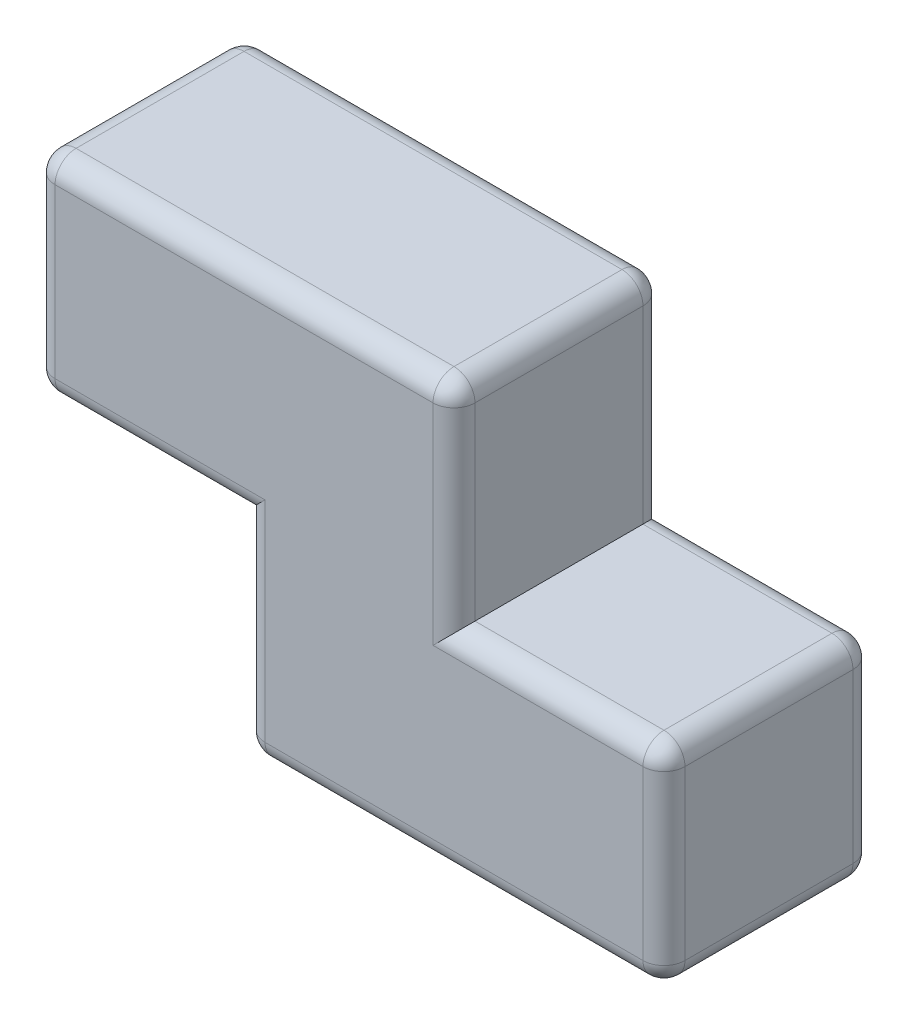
ISO-10303-21;
HEADER;
FILE_DESCRIPTION(('STEP AP214'),'2;1');
FILE_NAME('part.step','',(''),(''),'','','');
FILE_SCHEMA(('AUTOMOTIVE_DESIGN { 1 0 10303 214 1 1 1 1 }'));
ENDSEC;
DATA;
#1=APPLICATION_CONTEXT('core data for automotive mechanical design processes');
#2=APPLICATION_PROTOCOL_DEFINITION('international standard','automotive_design',2000,#1);
#3=PRODUCT_CONTEXT('',#1,'mechanical');
#4=PRODUCT('Part','Part','',(#3));
#5=PRODUCT_RELATED_PRODUCT_CATEGORY('part','',(#4));
#6=PRODUCT_DEFINITION_FORMATION('','',#4);
#7=PRODUCT_DEFINITION_CONTEXT('part definition',#1,'design');
#8=PRODUCT_DEFINITION('design','',#6,#7);
#9=PRODUCT_DEFINITION_SHAPE('','',#8);
#10=(LENGTH_UNIT() NAMED_UNIT(*) SI_UNIT(.MILLI.,.METRE.));
#11=(NAMED_UNIT(*) PLANE_ANGLE_UNIT() SI_UNIT($,.RADIAN.));
#12=(NAMED_UNIT(*) SI_UNIT($,.STERADIAN.) SOLID_ANGLE_UNIT());
#13=UNCERTAINTY_MEASURE_WITH_UNIT(LENGTH_MEASURE(1.E-05),#10,'distance_accuracy_value','');
#14=(GEOMETRIC_REPRESENTATION_CONTEXT(3) GLOBAL_UNCERTAINTY_ASSIGNED_CONTEXT((#13)) GLOBAL_UNIT_ASSIGNED_CONTEXT((#10,
#11,#12)) REPRESENTATION_CONTEXT('',''));
#15=CARTESIAN_POINT('',(0.,0.,0.));
#16=DIRECTION('',(0.,0.,1.));
#17=DIRECTION('',(1.,0.,0.));
#18=AXIS2_PLACEMENT_3D('',#15,#16,#17);
#19=CARTESIAN_POINT('',(-326.4,114.74031182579,100.));
#20=DIRECTION('',(1.,0.,0.));
#21=DIRECTION('',(0.,1.,0.));
#22=AXIS2_PLACEMENT_3D('',#19,#20,#21);
#23=PLANE('',#22);
#24=DIRECTION('',(0.,-1.,0.));
#25=VECTOR('',#24,1.);
#26=CARTESIAN_POINT('',(-326.4,114.74031182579,9.99999999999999));
#27=LINE('',#26,#25);
#28=CARTESIAN_POINT('',(-326.4,104.74031182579,9.99999999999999));
#29=VERTEX_POINT('',#28);
#30=CARTESIAN_POINT('',(-326.4,24.7403118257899,9.99999999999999));
#31=VERTEX_POINT('',#30);
#32=EDGE_CURVE('E284',#29,#31,#27,.T.);
#33=ORIENTED_EDGE('',*,*,#32,.T.);
#34=DIRECTION('',(0.,0.,-1.));
#35=VECTOR('',#34,1.);
#36=CARTESIAN_POINT('',(-326.4,24.7403118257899,100.));
#37=LINE('',#36,#35);
#38=CARTESIAN_POINT('',(-326.4,24.7403118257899,90.));
#39=VERTEX_POINT('',#38);
#40=EDGE_CURVE('E286',#31,#39,#37,.F.);
#41=ORIENTED_EDGE('',*,*,#40,.T.);
#42=DIRECTION('',(0.,-1.,0.));
#43=VECTOR('',#42,1.);
#44=CARTESIAN_POINT('',(-326.4,114.74031182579,90.));
#45=LINE('',#44,#43);
#46=CARTESIAN_POINT('',(-326.4,104.74031182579,90.));
#47=VERTEX_POINT('',#46);
#48=EDGE_CURVE('E282',#39,#47,#45,.F.);
#49=ORIENTED_EDGE('',*,*,#48,.T.);
#50=DIRECTION('',(0.,0.,-1.));
#51=VECTOR('',#50,1.);
#52=CARTESIAN_POINT('',(-326.4,104.74031182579,100.));
#53=LINE('',#52,#51);
#54=EDGE_CURVE('E280',#47,#29,#53,.T.);
#55=ORIENTED_EDGE('',*,*,#54,.T.);
#56=EDGE_LOOP('',(#33,#41,#49,#55));
#57=FACE_BOUND('',#56,.T.);
#58=ADVANCED_FACE('F37',(#57),#23,.F.);
#59=CARTESIAN_POINT('',(-326.4,14.7403118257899,100.));
#60=DIRECTION('',(0.,1.,0.));
#61=DIRECTION('',(0.,0.,1.));
#62=AXIS2_PLACEMENT_3D('',#59,#60,#61);
#63=PLANE('',#62);
#64=DIRECTION('',(0.,0.,-1.));
#65=VECTOR('',#64,1.);
#66=CARTESIAN_POINT('',(-316.4,14.7403118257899,100.));
#67=LINE('',#66,#65);
#68=CARTESIAN_POINT('',(-316.4,14.7403118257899,90.));
#69=VERTEX_POINT('',#68);
#70=CARTESIAN_POINT('',(-316.4,14.7403118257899,9.99999999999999));
#71=VERTEX_POINT('',#70);
#72=EDGE_CURVE('E257',#69,#71,#67,.T.);
#73=ORIENTED_EDGE('',*,*,#72,.T.);
#74=DIRECTION('',(1.,0.,0.));
#75=VECTOR('',#74,1.);
#76=CARTESIAN_POINT('',(-326.4,14.7403118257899,9.99999999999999));
#77=LINE('',#76,#75);
#78=CARTESIAN_POINT('',(-226.4,14.7403118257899,9.99999999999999));
#79=VERTEX_POINT('',#78);
#80=EDGE_CURVE('E259',#71,#79,#77,.T.);
#81=ORIENTED_EDGE('',*,*,#80,.T.);
#82=DIRECTION('',(0.,0.,-1.));
#83=VECTOR('',#82,1.);
#84=CARTESIAN_POINT('',(-226.4,14.7403118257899,100.));
#85=LINE('',#84,#83);
#86=CARTESIAN_POINT('',(-226.4,14.7403118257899,90.));
#87=VERTEX_POINT('',#86);
#88=EDGE_CURVE('E206',#87,#79,#85,.T.);
#89=ORIENTED_EDGE('',*,*,#88,.F.);
#90=DIRECTION('',(1.,0.,0.));
#91=VECTOR('',#90,1.);
#92=CARTESIAN_POINT('',(-326.4,14.7403118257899,90.));
#93=LINE('',#92,#91);
#94=EDGE_CURVE('E255',#87,#69,#93,.F.);
#95=ORIENTED_EDGE('',*,*,#94,.T.);
#96=EDGE_LOOP('',(#73,#81,#89,#95));
#97=FACE_BOUND('',#96,.T.);
#98=ADVANCED_FACE('F461',(#97),#63,.F.);
#99=CARTESIAN_POINT('',(-226.4,14.7403118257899,100.));
#100=DIRECTION('',(1.,0.,0.));
#101=DIRECTION('',(0.,1.,0.));
#102=AXIS2_PLACEMENT_3D('',#99,#100,#101);
#103=PLANE('',#102);
#104=ORIENTED_EDGE('',*,*,#88,.T.);
#105=DIRECTION('',(0.,-1.,0.));
#106=VECTOR('',#105,1.);
#107=CARTESIAN_POINT('',(-226.4,14.7403118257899,9.99999999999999));
#108=LINE('',#107,#106);
#109=CARTESIAN_POINT('',(-226.4,-75.2596881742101,9.99999999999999));
#110=VERTEX_POINT('',#109);
#111=EDGE_CURVE('E253',#79,#110,#108,.T.);
#112=ORIENTED_EDGE('',*,*,#111,.T.);
#113=DIRECTION('',(0.,0.,-1.));
#114=VECTOR('',#113,1.);
#115=CARTESIAN_POINT('',(-226.4,-75.2596881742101,100.));
#116=LINE('',#115,#114);
#117=CARTESIAN_POINT('',(-226.4,-75.2596881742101,90.));
#118=VERTEX_POINT('',#117);
#119=EDGE_CURVE('E250',#110,#118,#116,.F.);
#120=ORIENTED_EDGE('',*,*,#119,.T.);
#121=DIRECTION('',(0.,-1.,0.));
#122=VECTOR('',#121,1.);
#123=CARTESIAN_POINT('',(-226.4,14.7403118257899,90.));
#124=LINE('',#123,#122);
#125=EDGE_CURVE('E248',#118,#87,#124,.F.);
#126=ORIENTED_EDGE('',*,*,#125,.T.);
#127=EDGE_LOOP('',(#104,#112,#120,#126));
#128=FACE_BOUND('',#127,.T.);
#129=ADVANCED_FACE('F463',(#128),#103,.F.);
#130=CARTESIAN_POINT('',(-126.4,-85.2596881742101,100.));
#131=DIRECTION('',(0.,1.,0.));
#132=DIRECTION('',(0.,0.,1.));
#133=AXIS2_PLACEMENT_3D('',#130,#131,#132);
#134=PLANE('',#133);
#135=DIRECTION('',(0.,0.,-1.));
#136=VECTOR('',#135,1.);
#137=CARTESIAN_POINT('',(-216.4,-85.2596881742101,100.));
#138=LINE('',#137,#136);
#139=CARTESIAN_POINT('',(-216.4,-85.2596881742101,90.));
#140=VERTEX_POINT('',#139);
#141=CARTESIAN_POINT('',(-216.4,-85.2596881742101,9.99999999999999));
#142=VERTEX_POINT('',#141);
#143=EDGE_CURVE('E243',#140,#142,#138,.T.);
#144=ORIENTED_EDGE('',*,*,#143,.T.);
#145=DIRECTION('',(1.,0.,0.));
#146=VECTOR('',#145,1.);
#147=CARTESIAN_POINT('',(-126.4,-85.2596881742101,9.99999999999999));
#148=LINE('',#147,#146);
#149=CARTESIAN_POINT('',(-36.3999999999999,-85.2596881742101,9.99999999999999));
#150=VERTEX_POINT('',#149);
#151=EDGE_CURVE('E246',#142,#150,#148,.T.);
#152=ORIENTED_EDGE('',*,*,#151,.T.);
#153=DIRECTION('',(0.,0.,-1.));
#154=VECTOR('',#153,1.);
#155=CARTESIAN_POINT('',(-36.3999999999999,-85.2596881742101,100.));
#156=LINE('',#155,#154);
#157=CARTESIAN_POINT('',(-36.3999999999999,-85.2596881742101,90.));
#158=VERTEX_POINT('',#157);
#159=EDGE_CURVE('E241',#150,#158,#156,.F.);
#160=ORIENTED_EDGE('',*,*,#159,.T.);
#161=DIRECTION('',(1.,0.,0.));
#162=VECTOR('',#161,1.);
#163=CARTESIAN_POINT('',(-226.4,-85.2596881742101,90.));
#164=LINE('',#163,#162);
#165=EDGE_CURVE('E239',#158,#140,#164,.F.);
#166=ORIENTED_EDGE('',*,*,#165,.T.);
#167=EDGE_LOOP('',(#144,#152,#160,#166));
#168=FACE_BOUND('',#167,.T.);
#169=ADVANCED_FACE('F582',(#168),#134,.F.);
#170=CARTESIAN_POINT('',(-26.3999999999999,14.7403118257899,100.));
#171=DIRECTION('',(-1.,0.,0.));
#172=DIRECTION('',(0.,-1.,0.));
#173=AXIS2_PLACEMENT_3D('',#170,#171,#172);
#174=PLANE('',#173);
#175=DIRECTION('',(0.,0.,-1.));
#176=VECTOR('',#175,1.);
#177=CARTESIAN_POINT('',(-26.3999999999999,-75.2596881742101,100.));
#178=LINE('',#177,#176);
#179=CARTESIAN_POINT('',(-26.3999999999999,-75.2596881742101,90.));
#180=VERTEX_POINT('',#179);
#181=CARTESIAN_POINT('',(-26.3999999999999,-75.2596881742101,9.99999999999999));
#182=VERTEX_POINT('',#181);
#183=EDGE_CURVE('E232',#180,#182,#178,.T.);
#184=ORIENTED_EDGE('',*,*,#183,.T.);
#185=DIRECTION('',(0.,1.,0.));
#186=VECTOR('',#185,1.);
#187=CARTESIAN_POINT('',(-26.3999999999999,14.7403118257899,9.99999999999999));
#188=LINE('',#187,#186);
#189=CARTESIAN_POINT('',(-26.3999999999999,4.7403118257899,9.99999999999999));
#190=VERTEX_POINT('',#189);
#191=EDGE_CURVE('E237',#182,#190,#188,.T.);
#192=ORIENTED_EDGE('',*,*,#191,.T.);
#193=DIRECTION('',(0.,0.,-1.));
#194=VECTOR('',#193,1.);
#195=CARTESIAN_POINT('',(-26.3999999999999,4.7403118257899,100.));
#196=LINE('',#195,#194);
#197=CARTESIAN_POINT('',(-26.3999999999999,4.7403118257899,90.));
#198=VERTEX_POINT('',#197);
#199=EDGE_CURVE('E234',#190,#198,#196,.F.);
#200=ORIENTED_EDGE('',*,*,#199,.T.);
#201=DIRECTION('',(0.,1.,0.));
#202=VECTOR('',#201,1.);
#203=CARTESIAN_POINT('',(-26.3999999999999,-85.2596881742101,90.));
#204=LINE('',#203,#202);
#205=EDGE_CURVE('E230',#198,#180,#204,.F.);
#206=ORIENTED_EDGE('',*,*,#205,.T.);
#207=EDGE_LOOP('',(#184,#192,#200,#206));
#208=FACE_BOUND('',#207,.T.);
#209=ADVANCED_FACE('F589',(#208),#174,.F.);
#210=CARTESIAN_POINT('',(-126.4,14.7403118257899,100.));
#211=DIRECTION('',(0.,-1.,0.));
#212=DIRECTION('',(1.,0.,0.));
#213=AXIS2_PLACEMENT_3D('',#210,#211,#212);
#214=PLANE('',#213);
#215=DIRECTION('',(0.,0.,-1.));
#216=VECTOR('',#215,1.);
#217=CARTESIAN_POINT('',(-36.3999999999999,14.7403118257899,100.));
#218=LINE('',#217,#216);
#219=CARTESIAN_POINT('',(-36.3999999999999,14.7403118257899,90.));
#220=VERTEX_POINT('',#219);
#221=CARTESIAN_POINT('',(-36.3999999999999,14.7403118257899,9.99999999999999));
#222=VERTEX_POINT('',#221);
#223=EDGE_CURVE('E223',#220,#222,#218,.T.);
#224=ORIENTED_EDGE('',*,*,#223,.T.);
#225=DIRECTION('',(-1.,0.,0.));
#226=VECTOR('',#225,1.);
#227=CARTESIAN_POINT('',(-126.4,14.7403118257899,9.99999999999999));
#228=LINE('',#227,#226);
#229=CARTESIAN_POINT('',(-126.4,14.7403118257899,9.99999999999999));
#230=VERTEX_POINT('',#229);
#231=EDGE_CURVE('E205',#222,#230,#228,.T.);
#232=ORIENTED_EDGE('',*,*,#231,.T.);
#233=DIRECTION('',(0.,0.,-1.));
#234=VECTOR('',#233,1.);
#235=CARTESIAN_POINT('',(-126.4,14.7403118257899,100.));
#236=LINE('',#235,#234);
#237=CARTESIAN_POINT('',(-126.4,14.7403118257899,90.));
#238=VERTEX_POINT('',#237);
#239=EDGE_CURVE('E189',#238,#230,#236,.T.);
#240=ORIENTED_EDGE('',*,*,#239,.F.);
#241=DIRECTION('',(-1.,0.,0.));
#242=VECTOR('',#241,1.);
#243=CARTESIAN_POINT('',(-26.3999999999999,14.7403118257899,90.));
#244=LINE('',#243,#242);
#245=EDGE_CURVE('E202',#238,#220,#244,.F.);
#246=ORIENTED_EDGE('',*,*,#245,.T.);
#247=EDGE_LOOP('',(#224,#232,#240,#246));
#248=FACE_BOUND('',#247,.T.);
#249=ADVANCED_FACE('F200',(#248),#214,.F.);
#250=CARTESIAN_POINT('',(-126.4,114.74031182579,100.));
#251=DIRECTION('',(-1.,0.,0.));
#252=DIRECTION('',(0.,0.,1.));
#253=AXIS2_PLACEMENT_3D('',#250,#251,#252);
#254=PLANE('',#253);
#255=ORIENTED_EDGE('',*,*,#239,.T.);
#256=DIRECTION('',(0.,1.,0.));
#257=VECTOR('',#256,1.);
#258=CARTESIAN_POINT('',(-126.4,114.74031182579,9.99999999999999));
#259=LINE('',#258,#257);
#260=CARTESIAN_POINT('',(-126.4,104.74031182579,9.99999999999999));
#261=VERTEX_POINT('',#260);
#262=EDGE_CURVE('E196',#230,#261,#259,.T.);
#263=ORIENTED_EDGE('',*,*,#262,.T.);
#264=DIRECTION('',(0.,0.,-1.));
#265=VECTOR('',#264,1.);
#266=CARTESIAN_POINT('',(-126.4,104.74031182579,100.));
#267=LINE('',#266,#265);
#268=CARTESIAN_POINT('',(-126.4,104.74031182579,90.));
#269=VERTEX_POINT('',#268);
#270=EDGE_CURVE('E192',#261,#269,#267,.F.);
#271=ORIENTED_EDGE('',*,*,#270,.T.);
#272=DIRECTION('',(0.,1.,0.));
#273=VECTOR('',#272,1.);
#274=CARTESIAN_POINT('',(-126.4,14.7403118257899,90.));
#275=LINE('',#274,#273);
#276=EDGE_CURVE('E186',#269,#238,#275,.F.);
#277=ORIENTED_EDGE('',*,*,#276,.T.);
#278=EDGE_LOOP('',(#255,#263,#271,#277));
#279=FACE_BOUND('',#278,.T.);
#280=ADVANCED_FACE('F188',(#279),#254,.F.);
#281=CARTESIAN_POINT('',(-326.4,114.74031182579,100.));
#282=DIRECTION('',(0.,-1.,0.));
#283=DIRECTION('',(0.,0.,-1.));
#284=AXIS2_PLACEMENT_3D('',#281,#282,#283);
#285=PLANE('',#284);
#286=DIRECTION('',(-1.,0.,0.));
#287=VECTOR('',#286,1.);
#288=CARTESIAN_POINT('',(-126.4,114.74031182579,90.));
#289=LINE('',#288,#287);
#290=CARTESIAN_POINT('',(-316.4,114.74031182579,90.));
#291=VERTEX_POINT('',#290);
#292=CARTESIAN_POINT('',(-136.4,114.74031182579,90.));
#293=VERTEX_POINT('',#292);
#294=EDGE_CURVE('E46',#291,#293,#289,.F.);
#295=ORIENTED_EDGE('',*,*,#294,.T.);
#296=DIRECTION('',(0.,0.,-1.));
#297=VECTOR('',#296,1.);
#298=CARTESIAN_POINT('',(-136.4,114.74031182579,100.));
#299=LINE('',#298,#297);
#300=CARTESIAN_POINT('',(-136.4,114.74031182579,9.99999999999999));
#301=VERTEX_POINT('',#300);
#302=EDGE_CURVE('E11',#293,#301,#299,.T.);
#303=ORIENTED_EDGE('',*,*,#302,.T.);
#304=DIRECTION('',(-1.,0.,0.));
#305=VECTOR('',#304,1.);
#306=CARTESIAN_POINT('',(-326.4,114.74031182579,9.99999999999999));
#307=LINE('',#306,#305);
#308=CARTESIAN_POINT('',(-316.4,114.74031182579,9.99999999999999));
#309=VERTEX_POINT('',#308);
#310=EDGE_CURVE('E304',#301,#309,#307,.T.);
#311=ORIENTED_EDGE('',*,*,#310,.T.);
#312=DIRECTION('',(0.,0.,-1.));
#313=VECTOR('',#312,1.);
#314=CARTESIAN_POINT('',(-316.4,114.74031182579,100.));
#315=LINE('',#314,#313);
#316=EDGE_CURVE('E57',#309,#291,#315,.F.);
#317=ORIENTED_EDGE('',*,*,#316,.T.);
#318=EDGE_LOOP('',(#295,#303,#311,#317));
#319=FACE_BOUND('',#318,.T.);
#320=ADVANCED_FACE('F512',(#319),#285,.F.);
#321=CARTESIAN_POINT('',(0.,0.,100.));
#322=DIRECTION('',(0.,0.,1.));
#323=DIRECTION('',(1.,0.,0.));
#324=AXIS2_PLACEMENT_3D('',#321,#322,#323);
#325=PLANE('',#324);
#326=DIRECTION('',(-1.,0.,0.));
#327=VECTOR('',#326,1.);
#328=CARTESIAN_POINT('',(-126.4,4.7403118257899,100.));
#329=LINE('',#328,#327);
#330=CARTESIAN_POINT('',(-36.3999999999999,4.7403118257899,100.));
#331=VERTEX_POINT('',#330);
#332=CARTESIAN_POINT('',(-136.4,4.7403118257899,100.));
#333=VERTEX_POINT('',#332);
#334=EDGE_CURVE('E301',#331,#333,#329,.T.);
#335=ORIENTED_EDGE('',*,*,#334,.T.);
#336=DIRECTION('',(0.,1.,0.));
#337=VECTOR('',#336,1.);
#338=CARTESIAN_POINT('',(-136.4,114.74031182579,100.));
#339=LINE('',#338,#337);
#340=CARTESIAN_POINT('',(-136.4,104.74031182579,100.));
#341=VERTEX_POINT('',#340);
#342=EDGE_CURVE('E213',#333,#341,#339,.T.);
#343=ORIENTED_EDGE('',*,*,#342,.T.);
#344=DIRECTION('',(-1.,0.,0.));
#345=VECTOR('',#344,1.);
#346=CARTESIAN_POINT('',(-326.4,104.74031182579,100.));
#347=LINE('',#346,#345);
#348=CARTESIAN_POINT('',(-316.4,104.74031182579,100.));
#349=VERTEX_POINT('',#348);
#350=EDGE_CURVE('E289',#341,#349,#347,.T.);
#351=ORIENTED_EDGE('',*,*,#350,.T.);
#352=DIRECTION('',(0.,-1.,0.));
#353=VECTOR('',#352,1.);
#354=CARTESIAN_POINT('',(-316.4,14.7403118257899,100.));
#355=LINE('',#354,#353);
#356=CARTESIAN_POINT('',(-316.4,24.7403118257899,100.));
#357=VERTEX_POINT('',#356);
#358=EDGE_CURVE('E291',#349,#357,#355,.T.);
#359=ORIENTED_EDGE('',*,*,#358,.T.);
#360=DIRECTION('',(1.,0.,0.));
#361=VECTOR('',#360,1.);
#362=CARTESIAN_POINT('',(-226.4,24.7403118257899,100.));
#363=LINE('',#362,#361);
#364=CARTESIAN_POINT('',(-216.4,24.7403118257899,100.));
#365=VERTEX_POINT('',#364);
#366=EDGE_CURVE('E293',#357,#365,#363,.T.);
#367=ORIENTED_EDGE('',*,*,#366,.T.);
#368=DIRECTION('',(0.,-1.,0.));
#369=VECTOR('',#368,1.);
#370=CARTESIAN_POINT('',(-216.4,-85.2596881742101,100.));
#371=LINE('',#370,#369);
#372=CARTESIAN_POINT('',(-216.4,-75.2596881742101,100.));
#373=VERTEX_POINT('',#372);
#374=EDGE_CURVE('E295',#365,#373,#371,.T.);
#375=ORIENTED_EDGE('',*,*,#374,.T.);
#376=DIRECTION('',(1.,0.,0.));
#377=VECTOR('',#376,1.);
#378=CARTESIAN_POINT('',(-26.3999999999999,-75.2596881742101,100.));
#379=LINE('',#378,#377);
#380=CARTESIAN_POINT('',(-36.3999999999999,-75.2596881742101,100.));
#381=VERTEX_POINT('',#380);
#382=EDGE_CURVE('E297',#373,#381,#379,.T.);
#383=ORIENTED_EDGE('',*,*,#382,.T.);
#384=DIRECTION('',(0.,1.,0.));
#385=VECTOR('',#384,1.);
#386=CARTESIAN_POINT('',(-36.3999999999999,14.7403118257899,100.));
#387=LINE('',#386,#385);
#388=EDGE_CURVE('E299',#381,#331,#387,.T.);
#389=ORIENTED_EDGE('',*,*,#388,.T.);
#390=EDGE_LOOP('',(#335,#343,#351,#359,#367,#375,#383,#389));
#391=FACE_BOUND('',#390,.T.);
#392=ADVANCED_FACE('F431',(#391),#325,.T.);
#393=CARTESIAN_POINT('',(0.,0.,0.));
#394=DIRECTION('',(0.,0.,1.));
#395=DIRECTION('',(1.,0.,0.));
#396=AXIS2_PLACEMENT_3D('',#393,#394,#395);
#397=PLANE('',#396);
#398=DIRECTION('',(0.,-1.,0.));
#399=VECTOR('',#398,1.);
#400=CARTESIAN_POINT('',(-216.4,2.40252262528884E-13,0.));
#401=LINE('',#400,#399);
#402=CARTESIAN_POINT('',(-216.4,-75.2596881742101,0.));
#403=VERTEX_POINT('',#402);
#404=CARTESIAN_POINT('',(-216.4,24.7403118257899,0.));
#405=VERTEX_POINT('',#404);
#406=EDGE_CURVE('E273',#403,#405,#401,.F.);
#407=ORIENTED_EDGE('',*,*,#406,.T.);
#408=DIRECTION('',(1.,0.,0.));
#409=VECTOR('',#408,1.);
#410=CARTESIAN_POINT('',(0.,24.7403118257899,0.));
#411=LINE('',#410,#409);
#412=CARTESIAN_POINT('',(-316.4,24.7403118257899,0.));
#413=VERTEX_POINT('',#412);
#414=EDGE_CURVE('E275',#405,#413,#411,.F.);
#415=ORIENTED_EDGE('',*,*,#414,.T.);
#416=DIRECTION('',(0.,-1.,0.));
#417=VECTOR('',#416,1.);
#418=CARTESIAN_POINT('',(-316.4,-3.51274564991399E-13,0.));
#419=LINE('',#418,#417);
#420=CARTESIAN_POINT('',(-316.4,104.74031182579,0.));
#421=VERTEX_POINT('',#420);
#422=EDGE_CURVE('E263',#413,#421,#419,.F.);
#423=ORIENTED_EDGE('',*,*,#422,.T.);
#424=DIRECTION('',(-1.,0.,0.));
#425=VECTOR('',#424,1.);
#426=CARTESIAN_POINT('',(0.,104.74031182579,0.));
#427=LINE('',#426,#425);
#428=CARTESIAN_POINT('',(-136.4,104.74031182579,0.));
#429=VERTEX_POINT('',#428);
#430=EDGE_CURVE('E261',#421,#429,#427,.F.);
#431=ORIENTED_EDGE('',*,*,#430,.T.);
#432=DIRECTION('',(0.,1.,0.));
#433=VECTOR('',#432,1.);
#434=CARTESIAN_POINT('',(-136.4,0.,0.));
#435=LINE('',#434,#433);
#436=CARTESIAN_POINT('',(-136.4,4.7403118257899,0.));
#437=VERTEX_POINT('',#436);
#438=EDGE_CURVE('E265',#429,#437,#435,.F.);
#439=ORIENTED_EDGE('',*,*,#438,.T.);
#440=DIRECTION('',(-1.,0.,0.));
#441=VECTOR('',#440,1.);
#442=CARTESIAN_POINT('',(0.,4.7403118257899,0.));
#443=LINE('',#442,#441);
#444=CARTESIAN_POINT('',(-36.3999999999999,4.7403118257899,0.));
#445=VERTEX_POINT('',#444);
#446=EDGE_CURVE('E267',#437,#445,#443,.F.);
#447=ORIENTED_EDGE('',*,*,#446,.T.);
#448=DIRECTION('',(0.,1.,0.));
#449=VECTOR('',#448,1.);
#450=CARTESIAN_POINT('',(-36.3999999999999,0.,0.));
#451=LINE('',#450,#449);
#452=CARTESIAN_POINT('',(-36.3999999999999,-75.2596881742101,0.));
#453=VERTEX_POINT('',#452);
#454=EDGE_CURVE('E269',#445,#453,#451,.F.);
#455=ORIENTED_EDGE('',*,*,#454,.T.);
#456=DIRECTION('',(1.,0.,0.));
#457=VECTOR('',#456,1.);
#458=CARTESIAN_POINT('',(0.,-75.2596881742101,0.));
#459=LINE('',#458,#457);
#460=EDGE_CURVE('E271',#453,#403,#459,.F.);
#461=ORIENTED_EDGE('',*,*,#460,.T.);
#462=EDGE_LOOP('',(#407,#415,#423,#431,#439,#447,#455,#461));
#463=FACE_BOUND('',#462,.T.);
#464=ADVANCED_FACE('F593',(#463),#397,.F.);
#465=CARTESIAN_POINT('',(-316.4,24.7403118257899,100.));
#466=DIRECTION('',(0.,0.,-1.));
#467=DIRECTION('',(-1.,0.,0.));
#468=AXIS2_PLACEMENT_3D('',#465,#466,#467);
#469=CYLINDRICAL_SURFACE('',#468,10.);
#470=CARTESIAN_POINT('',(-316.4,24.7403118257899,90.));
#471=DIRECTION('',(0.,0.,1.));
#472=DIRECTION('',(1.,0.,0.));
#473=AXIS2_PLACEMENT_3D('',#470,#471,#472);
#474=CIRCLE('',#473,10.);
#475=EDGE_CURVE('E41',#39,#69,#474,.T.);
#476=ORIENTED_EDGE('',*,*,#475,.F.);
#477=ORIENTED_EDGE('',*,*,#40,.F.);
#478=CARTESIAN_POINT('',(-316.4,24.7403118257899,9.99999999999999));
#479=DIRECTION('',(0.,0.,-1.));
#480=DIRECTION('',(-1.,0.,0.));
#481=AXIS2_PLACEMENT_3D('',#478,#479,#480);
#482=CIRCLE('',#481,10.);
#483=EDGE_CURVE('E409',#71,#31,#482,.T.);
#484=ORIENTED_EDGE('',*,*,#483,.F.);
#485=ORIENTED_EDGE('',*,*,#72,.F.);
#486=EDGE_LOOP('',(#476,#477,#484,#485));
#487=FACE_BOUND('',#486,.T.);
#488=ADVANCED_FACE('F39',(#487),#469,.T.);
#489=CARTESIAN_POINT('',(-316.4,24.7403118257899,90.));
#490=DIRECTION('',(0.,0.,1.));
#491=DIRECTION('',(1.,0.,0.));
#492=AXIS2_PLACEMENT_3D('',#489,#490,#491);
#493=SPHERICAL_SURFACE('',#492,10.);
#494=CARTESIAN_POINT('',(-316.4,24.7403118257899,90.));
#495=DIRECTION('',(0.,-1.,0.));
#496=DIRECTION('',(1.,0.,0.));
#497=AXIS2_PLACEMENT_3D('',#494,#495,#496);
#498=CIRCLE('',#497,10.);
#499=EDGE_CURVE('E404',#39,#357,#498,.F.);
#500=ORIENTED_EDGE('',*,*,#499,.F.);
#501=ORIENTED_EDGE('',*,*,#475,.T.);
#502=CARTESIAN_POINT('',(-316.4,24.7403118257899,90.));
#503=DIRECTION('',(-1.,0.,0.));
#504=DIRECTION('',(0.,0.,1.));
#505=AXIS2_PLACEMENT_3D('',#502,#503,#504);
#506=CIRCLE('',#505,10.);
#507=EDGE_CURVE('E407',#357,#69,#506,.F.);
#508=ORIENTED_EDGE('',*,*,#507,.F.);
#509=EDGE_LOOP('',(#500,#501,#508));
#510=FACE_BOUND('',#509,.T.);
#511=ADVANCED_FACE('F420',(#510),#493,.T.);
#512=CARTESIAN_POINT('',(-316.4,24.7403118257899,10.));
#513=DIRECTION('',(0.,0.,1.));
#514=DIRECTION('',(1.,0.,0.));
#515=AXIS2_PLACEMENT_3D('',#512,#513,#514);
#516=SPHERICAL_SURFACE('',#515,10.);
#517=CARTESIAN_POINT('',(-316.4,24.7403118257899,10.));
#518=DIRECTION('',(-1.,0.,0.));
#519=DIRECTION('',(0.,0.,1.));
#520=AXIS2_PLACEMENT_3D('',#517,#518,#519);
#521=CIRCLE('',#520,10.);
#522=EDGE_CURVE('E398',#71,#413,#521,.F.);
#523=ORIENTED_EDGE('',*,*,#522,.F.);
#524=ORIENTED_EDGE('',*,*,#483,.T.);
#525=CARTESIAN_POINT('',(-316.4,24.7403118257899,9.99999999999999));
#526=DIRECTION('',(0.,-1.,0.));
#527=DIRECTION('',(1.,0.,0.));
#528=AXIS2_PLACEMENT_3D('',#525,#526,#527);
#529=CIRCLE('',#528,10.);
#530=EDGE_CURVE('E401',#413,#31,#529,.F.);
#531=ORIENTED_EDGE('',*,*,#530,.F.);
#532=EDGE_LOOP('',(#523,#524,#531));
#533=FACE_BOUND('',#532,.T.);
#534=ADVANCED_FACE('F453',(#533),#516,.T.);
#535=CARTESIAN_POINT('',(0.,24.7403118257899,90.));
#536=DIRECTION('',(-1.,0.,0.));
#537=DIRECTION('',(0.,0.,1.));
#538=AXIS2_PLACEMENT_3D('',#535,#536,#537);
#539=CYLINDRICAL_SURFACE('',#538,10.);
#540=ORIENTED_EDGE('',*,*,#507,.T.);
#541=ORIENTED_EDGE('',*,*,#94,.F.);
#542=CARTESIAN_POINT('',(-216.4,24.7403118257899,90.));
#543=DIRECTION('',(-0.707106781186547,0.707106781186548,0.));
#544=DIRECTION('',(0.707106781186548,0.707106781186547,0.));
#545=AXIS2_PLACEMENT_3D('',#542,#543,#544);
#546=ELLIPSE('',#545,14.142135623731,10.);
#547=EDGE_CURVE('E395',#365,#87,#546,.F.);
#548=ORIENTED_EDGE('',*,*,#547,.F.);
#549=ORIENTED_EDGE('',*,*,#366,.F.);
#550=EDGE_LOOP('',(#540,#541,#548,#549));
#551=FACE_BOUND('',#550,.T.);
#552=ADVANCED_FACE('F427',(#551),#539,.T.);
#553=CARTESIAN_POINT('',(-316.4,-3.51274564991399E-13,90.));
#554=DIRECTION('',(0.,1.,0.));
#555=DIRECTION('',(-1.,0.,0.));
#556=AXIS2_PLACEMENT_3D('',#553,#554,#555);
#557=CYLINDRICAL_SURFACE('',#556,10.);
#558=ORIENTED_EDGE('',*,*,#499,.T.);
#559=ORIENTED_EDGE('',*,*,#358,.F.);
#560=CARTESIAN_POINT('',(-316.4,104.74031182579,90.));
#561=DIRECTION('',(0.,1.,0.));
#562=DIRECTION('',(-1.,0.,0.));
#563=AXIS2_PLACEMENT_3D('',#560,#561,#562);
#564=CIRCLE('',#563,10.);
#565=EDGE_CURVE('E392',#47,#349,#564,.T.);
#566=ORIENTED_EDGE('',*,*,#565,.F.);
#567=ORIENTED_EDGE('',*,*,#48,.F.);
#568=EDGE_LOOP('',(#558,#559,#566,#567));
#569=FACE_BOUND('',#568,.T.);
#570=ADVANCED_FACE('F437',(#569),#557,.T.);
#571=CARTESIAN_POINT('',(-316.4,104.74031182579,100.));
#572=DIRECTION('',(0.,0.,-1.));
#573=DIRECTION('',(-1.,0.,0.));
#574=AXIS2_PLACEMENT_3D('',#571,#572,#573);
#575=CYLINDRICAL_SURFACE('',#574,10.);
#576=CARTESIAN_POINT('',(-316.4,104.74031182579,9.99999999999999));
#577=DIRECTION('',(0.,0.,-1.));
#578=DIRECTION('',(-1.,0.,0.));
#579=AXIS2_PLACEMENT_3D('',#576,#577,#578);
#580=CIRCLE('',#579,10.);
#581=EDGE_CURVE('E386',#29,#309,#580,.T.);
#582=ORIENTED_EDGE('',*,*,#581,.F.);
#583=ORIENTED_EDGE('',*,*,#54,.F.);
#584=CARTESIAN_POINT('',(-316.4,104.74031182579,90.));
#585=DIRECTION('',(0.,0.,1.));
#586=DIRECTION('',(1.,0.,0.));
#587=AXIS2_PLACEMENT_3D('',#584,#585,#586);
#588=CIRCLE('',#587,10.);
#589=EDGE_CURVE('E389',#291,#47,#588,.T.);
#590=ORIENTED_EDGE('',*,*,#589,.F.);
#591=ORIENTED_EDGE('',*,*,#316,.F.);
#592=EDGE_LOOP('',(#582,#583,#590,#591));
#593=FACE_BOUND('',#592,.T.);
#594=ADVANCED_FACE('F443',(#593),#575,.T.);
#595=CARTESIAN_POINT('',(-316.4,114.74031182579,9.99999999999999));
#596=DIRECTION('',(0.,-1.,0.));
#597=DIRECTION('',(1.,0.,0.));
#598=AXIS2_PLACEMENT_3D('',#595,#596,#597);
#599=CYLINDRICAL_SURFACE('',#598,10.);
#600=ORIENTED_EDGE('',*,*,#530,.T.);
#601=ORIENTED_EDGE('',*,*,#32,.F.);
#602=CARTESIAN_POINT('',(-316.4,104.74031182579,10.));
#603=DIRECTION('',(0.,1.,0.));
#604=DIRECTION('',(-1.,0.,0.));
#605=AXIS2_PLACEMENT_3D('',#602,#603,#604);
#606=CIRCLE('',#605,10.);
#607=EDGE_CURVE('E383',#421,#29,#606,.T.);
#608=ORIENTED_EDGE('',*,*,#607,.F.);
#609=ORIENTED_EDGE('',*,*,#422,.F.);
#610=EDGE_LOOP('',(#600,#601,#608,#609));
#611=FACE_BOUND('',#610,.T.);
#612=ADVANCED_FACE('F451',(#611),#599,.T.);
#613=CARTESIAN_POINT('',(-326.4,24.7403118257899,9.99999999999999));
#614=DIRECTION('',(1.,0.,0.));
#615=DIRECTION('',(0.,0.,-1.));
#616=AXIS2_PLACEMENT_3D('',#613,#614,#615);
#617=CYLINDRICAL_SURFACE('',#616,10.);
#618=ORIENTED_EDGE('',*,*,#522,.T.);
#619=ORIENTED_EDGE('',*,*,#414,.F.);
#620=CARTESIAN_POINT('',(-216.4,24.7403118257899,9.99999999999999));
#621=DIRECTION('',(0.707106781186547,-0.707106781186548,0.));
#622=DIRECTION('',(0.707106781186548,0.707106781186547,0.));
#623=AXIS2_PLACEMENT_3D('',#620,#621,#622);
#624=ELLIPSE('',#623,14.142135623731,10.);
#625=EDGE_CURVE('E380',#79,#405,#624,.T.);
#626=ORIENTED_EDGE('',*,*,#625,.F.);
#627=ORIENTED_EDGE('',*,*,#80,.F.);
#628=EDGE_LOOP('',(#618,#619,#626,#627));
#629=FACE_BOUND('',#628,.T.);
#630=ADVANCED_FACE('F457',(#629),#617,.T.);
#631=CARTESIAN_POINT('',(-216.4,2.40252262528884E-13,90.));
#632=DIRECTION('',(0.,1.,0.));
#633=DIRECTION('',(-1.,0.,0.));
#634=AXIS2_PLACEMENT_3D('',#631,#632,#633);
#635=CYLINDRICAL_SURFACE('',#634,10.);
#636=ORIENTED_EDGE('',*,*,#547,.T.);
#637=ORIENTED_EDGE('',*,*,#125,.F.);
#638=CARTESIAN_POINT('',(-216.4,-75.2596881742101,90.));
#639=DIRECTION('',(0.,-1.,0.));
#640=DIRECTION('',(1.,0.,0.));
#641=AXIS2_PLACEMENT_3D('',#638,#639,#640);
#642=CIRCLE('',#641,10.);
#643=EDGE_CURVE('E375',#373,#118,#642,.T.);
#644=ORIENTED_EDGE('',*,*,#643,.F.);
#645=ORIENTED_EDGE('',*,*,#374,.F.);
#646=EDGE_LOOP('',(#636,#637,#644,#645));
#647=FACE_BOUND('',#646,.T.);
#648=ADVANCED_FACE('F467',(#647),#635,.T.);
#649=CARTESIAN_POINT('',(-316.4,104.74031182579,90.));
#650=DIRECTION('',(0.,0.,1.));
#651=DIRECTION('',(1.,0.,0.));
#652=AXIS2_PLACEMENT_3D('',#649,#650,#651);
#653=SPHERICAL_SURFACE('',#652,10.);
#654=ORIENTED_EDGE('',*,*,#589,.T.);
#655=ORIENTED_EDGE('',*,*,#565,.T.);
#656=CARTESIAN_POINT('',(-316.4,104.74031182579,90.));
#657=DIRECTION('',(-1.,0.,0.));
#658=DIRECTION('',(0.,0.,1.));
#659=AXIS2_PLACEMENT_3D('',#656,#657,#658);
#660=CIRCLE('',#659,10.);
#661=EDGE_CURVE('E372',#291,#349,#660,.F.);
#662=ORIENTED_EDGE('',*,*,#661,.F.);
#663=EDGE_LOOP('',(#654,#655,#662));
#664=FACE_BOUND('',#663,.T.);
#665=ADVANCED_FACE('F604',(#664),#653,.T.);
#666=CARTESIAN_POINT('',(-316.4,104.74031182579,10.));
#667=DIRECTION('',(0.,0.,1.));
#668=DIRECTION('',(1.,0.,0.));
#669=AXIS2_PLACEMENT_3D('',#666,#667,#668);
#670=SPHERICAL_SURFACE('',#669,10.);
#671=ORIENTED_EDGE('',*,*,#607,.T.);
#672=ORIENTED_EDGE('',*,*,#581,.T.);
#673=CARTESIAN_POINT('',(-316.4,104.74031182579,9.99999999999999));
#674=DIRECTION('',(-1.,0.,0.));
#675=DIRECTION('',(0.,0.,1.));
#676=AXIS2_PLACEMENT_3D('',#673,#674,#675);
#677=CIRCLE('',#676,10.);
#678=EDGE_CURVE('E369',#421,#309,#677,.F.);
#679=ORIENTED_EDGE('',*,*,#678,.F.);
#680=EDGE_LOOP('',(#671,#672,#679));
#681=FACE_BOUND('',#680,.T.);
#682=ADVANCED_FACE('F448',(#681),#670,.T.);
#683=CARTESIAN_POINT('',(-216.4,14.7403118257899,9.99999999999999));
#684=DIRECTION('',(0.,-1.,0.));
#685=DIRECTION('',(1.,0.,0.));
#686=AXIS2_PLACEMENT_3D('',#683,#684,#685);
#687=CYLINDRICAL_SURFACE('',#686,10.);
#688=ORIENTED_EDGE('',*,*,#625,.T.);
#689=ORIENTED_EDGE('',*,*,#406,.F.);
#690=CARTESIAN_POINT('',(-216.4,-75.2596881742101,9.99999999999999));
#691=DIRECTION('',(0.,-1.,0.));
#692=DIRECTION('',(1.,0.,0.));
#693=AXIS2_PLACEMENT_3D('',#690,#691,#692);
#694=CIRCLE('',#693,10.);
#695=EDGE_CURVE('E366',#110,#403,#694,.T.);
#696=ORIENTED_EDGE('',*,*,#695,.F.);
#697=ORIENTED_EDGE('',*,*,#111,.F.);
#698=EDGE_LOOP('',(#688,#689,#696,#697));
#699=FACE_BOUND('',#698,.T.);
#700=ADVANCED_FACE('F596',(#699),#687,.T.);
#701=CARTESIAN_POINT('',(-216.4,-75.2596881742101,100.));
#702=DIRECTION('',(0.,0.,-1.));
#703=DIRECTION('',(-1.,0.,0.));
#704=AXIS2_PLACEMENT_3D('',#701,#702,#703);
#705=CYLINDRICAL_SURFACE('',#704,10.);
#706=CARTESIAN_POINT('',(-216.4,-75.2596881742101,90.));
#707=DIRECTION('',(0.,0.,1.));
#708=DIRECTION('',(1.,0.,0.));
#709=AXIS2_PLACEMENT_3D('',#706,#707,#708);
#710=CIRCLE('',#709,10.);
#711=EDGE_CURVE('E377',#118,#140,#710,.T.);
#712=ORIENTED_EDGE('',*,*,#711,.F.);
#713=ORIENTED_EDGE('',*,*,#119,.F.);
#714=CARTESIAN_POINT('',(-216.4,-75.2596881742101,9.99999999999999));
#715=DIRECTION('',(0.,0.,-1.));
#716=DIRECTION('',(-1.,0.,0.));
#717=AXIS2_PLACEMENT_3D('',#714,#715,#716);
#718=CIRCLE('',#717,10.);
#719=EDGE_CURVE('E363',#142,#110,#718,.T.);
#720=ORIENTED_EDGE('',*,*,#719,.F.);
#721=ORIENTED_EDGE('',*,*,#143,.F.);
#722=EDGE_LOOP('',(#712,#713,#720,#721));
#723=FACE_BOUND('',#722,.T.);
#724=ADVANCED_FACE('F580',(#723),#705,.T.);
#725=CARTESIAN_POINT('',(-216.4,-75.2596881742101,90.));
#726=DIRECTION('',(0.,0.,1.));
#727=DIRECTION('',(1.,0.,0.));
#728=AXIS2_PLACEMENT_3D('',#725,#726,#727);
#729=SPHERICAL_SURFACE('',#728,10.);
#730=ORIENTED_EDGE('',*,*,#643,.T.);
#731=ORIENTED_EDGE('',*,*,#711,.T.);
#732=CARTESIAN_POINT('',(-216.4,-75.2596881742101,90.));
#733=DIRECTION('',(-1.,0.,0.));
#734=DIRECTION('',(0.,0.,1.));
#735=AXIS2_PLACEMENT_3D('',#732,#733,#734);
#736=CIRCLE('',#735,10.);
#737=EDGE_CURVE('E360',#373,#140,#736,.F.);
#738=ORIENTED_EDGE('',*,*,#737,.F.);
#739=EDGE_LOOP('',(#730,#731,#738));
#740=FACE_BOUND('',#739,.T.);
#741=ADVANCED_FACE('F472',(#740),#729,.T.);
#742=CARTESIAN_POINT('',(0.,104.74031182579,90.));
#743=DIRECTION('',(1.,0.,0.));
#744=DIRECTION('',(0.,0.,-1.));
#745=AXIS2_PLACEMENT_3D('',#742,#743,#744);
#746=CYLINDRICAL_SURFACE('',#745,10.);
#747=ORIENTED_EDGE('',*,*,#661,.T.);
#748=ORIENTED_EDGE('',*,*,#350,.F.);
#749=CARTESIAN_POINT('',(-136.4,104.74031182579,90.));
#750=DIRECTION('',(1.,0.,0.));
#751=DIRECTION('',(0.,0.,-1.));
#752=AXIS2_PLACEMENT_3D('',#749,#750,#751);
#753=CIRCLE('',#752,10.);
#754=EDGE_CURVE('E357',#293,#341,#753,.T.);
#755=ORIENTED_EDGE('',*,*,#754,.F.);
#756=ORIENTED_EDGE('',*,*,#294,.F.);
#757=EDGE_LOOP('',(#747,#748,#755,#756));
#758=FACE_BOUND('',#757,.T.);
#759=ADVANCED_FACE('F515',(#758),#746,.T.);
#760=CARTESIAN_POINT('',(-136.4,104.74031182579,100.));
#761=DIRECTION('',(0.,0.,-1.));
#762=DIRECTION('',(-1.,0.,0.));
#763=AXIS2_PLACEMENT_3D('',#760,#761,#762);
#764=CYLINDRICAL_SURFACE('',#763,10.);
#765=CARTESIAN_POINT('',(-136.4,104.74031182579,9.99999999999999));
#766=DIRECTION('',(0.,0.,-1.));
#767=DIRECTION('',(-1.,0.,0.));
#768=AXIS2_PLACEMENT_3D('',#765,#766,#767);
#769=CIRCLE('',#768,10.);
#770=EDGE_CURVE('E351',#301,#261,#769,.T.);
#771=ORIENTED_EDGE('',*,*,#770,.F.);
#772=ORIENTED_EDGE('',*,*,#302,.F.);
#773=CARTESIAN_POINT('',(-136.4,104.74031182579,90.));
#774=DIRECTION('',(0.,0.,1.));
#775=DIRECTION('',(1.,0.,0.));
#776=AXIS2_PLACEMENT_3D('',#773,#774,#775);
#777=CIRCLE('',#776,10.);
#778=EDGE_CURVE('E354',#269,#293,#777,.T.);
#779=ORIENTED_EDGE('',*,*,#778,.F.);
#780=ORIENTED_EDGE('',*,*,#270,.F.);
#781=EDGE_LOOP('',(#771,#772,#779,#780));
#782=FACE_BOUND('',#781,.T.);
#783=ADVANCED_FACE('F504',(#782),#764,.T.);
#784=CARTESIAN_POINT('',(-326.4,104.74031182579,9.99999999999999));
#785=DIRECTION('',(-1.,0.,0.));
#786=DIRECTION('',(0.,0.,1.));
#787=AXIS2_PLACEMENT_3D('',#784,#785,#786);
#788=CYLINDRICAL_SURFACE('',#787,10.);
#789=ORIENTED_EDGE('',*,*,#678,.T.);
#790=ORIENTED_EDGE('',*,*,#310,.F.);
#791=CARTESIAN_POINT('',(-136.4,104.74031182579,10.));
#792=DIRECTION('',(1.,0.,0.));
#793=DIRECTION('',(0.,0.,-1.));
#794=AXIS2_PLACEMENT_3D('',#791,#792,#793);
#795=CIRCLE('',#794,10.);
#796=EDGE_CURVE('E349',#429,#301,#795,.T.);
#797=ORIENTED_EDGE('',*,*,#796,.F.);
#798=ORIENTED_EDGE('',*,*,#430,.F.);
#799=EDGE_LOOP('',(#789,#790,#797,#798));
#800=FACE_BOUND('',#799,.T.);
#801=ADVANCED_FACE('F511',(#800),#788,.T.);
#802=CARTESIAN_POINT('',(-216.4,-75.2596881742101,10.));
#803=DIRECTION('',(0.,0.,1.));
#804=DIRECTION('',(1.,0.,0.));
#805=AXIS2_PLACEMENT_3D('',#802,#803,#804);
#806=SPHERICAL_SURFACE('',#805,10.);
#807=ORIENTED_EDGE('',*,*,#719,.T.);
#808=ORIENTED_EDGE('',*,*,#695,.T.);
#809=CARTESIAN_POINT('',(-216.4,-75.2596881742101,10.));
#810=DIRECTION('',(-1.,0.,0.));
#811=DIRECTION('',(0.,-1.,0.));
#812=AXIS2_PLACEMENT_3D('',#809,#810,#811);
#813=CIRCLE('',#812,10.);
#814=EDGE_CURVE('E346',#142,#403,#813,.F.);
#815=ORIENTED_EDGE('',*,*,#814,.F.);
#816=EDGE_LOOP('',(#807,#808,#815));
#817=FACE_BOUND('',#816,.T.);
#818=ADVANCED_FACE('F526',(#817),#806,.T.);
#819=CARTESIAN_POINT('',(0.,-75.2596881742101,90.));
#820=DIRECTION('',(-1.,0.,0.));
#821=DIRECTION('',(0.,0.,1.));
#822=AXIS2_PLACEMENT_3D('',#819,#820,#821);
#823=CYLINDRICAL_SURFACE('',#822,10.);
#824=ORIENTED_EDGE('',*,*,#737,.T.);
#825=ORIENTED_EDGE('',*,*,#165,.F.);
#826=CARTESIAN_POINT('',(-36.3999999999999,-75.2596881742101,90.));
#827=DIRECTION('',(1.,0.,0.));
#828=DIRECTION('',(0.,0.,-1.));
#829=AXIS2_PLACEMENT_3D('',#826,#827,#828);
#830=CIRCLE('',#829,10.);
#831=EDGE_CURVE('E340',#381,#158,#830,.T.);
#832=ORIENTED_EDGE('',*,*,#831,.F.);
#833=ORIENTED_EDGE('',*,*,#382,.F.);
#834=EDGE_LOOP('',(#824,#825,#832,#833));
#835=FACE_BOUND('',#834,.T.);
#836=ADVANCED_FACE('F476',(#835),#823,.T.);
#837=CARTESIAN_POINT('',(-136.4,104.74031182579,90.));
#838=DIRECTION('',(0.,0.,1.));
#839=DIRECTION('',(1.,0.,0.));
#840=AXIS2_PLACEMENT_3D('',#837,#838,#839);
#841=SPHERICAL_SURFACE('',#840,10.);
#842=ORIENTED_EDGE('',*,*,#778,.T.);
#843=ORIENTED_EDGE('',*,*,#754,.T.);
#844=CARTESIAN_POINT('',(-136.4,104.74031182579,90.));
#845=DIRECTION('',(0.,1.,0.));
#846=DIRECTION('',(0.,0.,1.));
#847=AXIS2_PLACEMENT_3D('',#844,#845,#846);
#848=CIRCLE('',#847,10.);
#849=EDGE_CURVE('E338',#269,#341,#848,.F.);
#850=ORIENTED_EDGE('',*,*,#849,.F.);
#851=EDGE_LOOP('',(#842,#843,#850));
#852=FACE_BOUND('',#851,.T.);
#853=ADVANCED_FACE('F517',(#852),#841,.T.);
#854=CARTESIAN_POINT('',(-136.4,104.74031182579,10.));
#855=DIRECTION('',(0.,0.,1.));
#856=DIRECTION('',(1.,0.,0.));
#857=AXIS2_PLACEMENT_3D('',#854,#855,#856);
#858=SPHERICAL_SURFACE('',#857,10.);
#859=ORIENTED_EDGE('',*,*,#796,.T.);
#860=ORIENTED_EDGE('',*,*,#770,.T.);
#861=CARTESIAN_POINT('',(-136.4,104.74031182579,9.99999999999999));
#862=DIRECTION('',(0.,1.,0.));
#863=DIRECTION('',(0.,0.,1.));
#864=AXIS2_PLACEMENT_3D('',#861,#862,#863);
#865=CIRCLE('',#864,10.);
#866=EDGE_CURVE('E335',#429,#261,#865,.F.);
#867=ORIENTED_EDGE('',*,*,#866,.F.);
#868=EDGE_LOOP('',(#859,#860,#867));
#869=FACE_BOUND('',#868,.T.);
#870=ADVANCED_FACE('F508',(#869),#858,.T.);
#871=CARTESIAN_POINT('',(-126.4,-75.2596881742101,9.99999999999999));
#872=DIRECTION('',(1.,0.,0.));
#873=DIRECTION('',(0.,0.,-1.));
#874=AXIS2_PLACEMENT_3D('',#871,#872,#873);
#875=CYLINDRICAL_SURFACE('',#874,10.);
#876=ORIENTED_EDGE('',*,*,#814,.T.);
#877=ORIENTED_EDGE('',*,*,#460,.F.);
#878=CARTESIAN_POINT('',(-36.3999999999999,-75.2596881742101,9.99999999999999));
#879=DIRECTION('',(1.,0.,0.));
#880=DIRECTION('',(0.,0.,-1.));
#881=AXIS2_PLACEMENT_3D('',#878,#879,#880);
#882=CIRCLE('',#881,10.);
#883=EDGE_CURVE('E332',#150,#453,#882,.T.);
#884=ORIENTED_EDGE('',*,*,#883,.F.);
#885=ORIENTED_EDGE('',*,*,#151,.F.);
#886=EDGE_LOOP('',(#876,#877,#884,#885));
#887=FACE_BOUND('',#886,.T.);
#888=ADVANCED_FACE('F524',(#887),#875,.T.);
#889=CARTESIAN_POINT('',(-36.3999999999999,-75.2596881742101,100.));
#890=DIRECTION('',(0.,0.,-1.));
#891=DIRECTION('',(-1.,0.,0.));
#892=AXIS2_PLACEMENT_3D('',#889,#890,#891);
#893=CYLINDRICAL_SURFACE('',#892,10.);
#894=CARTESIAN_POINT('',(-36.3999999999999,-75.2596881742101,90.));
#895=DIRECTION('',(0.,0.,1.));
#896=DIRECTION('',(1.,0.,0.));
#897=AXIS2_PLACEMENT_3D('',#894,#895,#896);
#898=CIRCLE('',#897,10.);
#899=EDGE_CURVE('E343',#158,#180,#898,.T.);
#900=ORIENTED_EDGE('',*,*,#899,.F.);
#901=ORIENTED_EDGE('',*,*,#159,.F.);
#902=CARTESIAN_POINT('',(-36.3999999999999,-75.2596881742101,9.99999999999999));
#903=DIRECTION('',(0.,0.,-1.));
#904=DIRECTION('',(-1.,0.,0.));
#905=AXIS2_PLACEMENT_3D('',#902,#903,#904);
#906=CIRCLE('',#905,10.);
#907=EDGE_CURVE('E329',#182,#150,#906,.T.);
#908=ORIENTED_EDGE('',*,*,#907,.F.);
#909=ORIENTED_EDGE('',*,*,#183,.F.);
#910=EDGE_LOOP('',(#900,#901,#908,#909));
#911=FACE_BOUND('',#910,.T.);
#912=ADVANCED_FACE('F563',(#911),#893,.T.);
#913=CARTESIAN_POINT('',(-36.3999999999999,-75.2596881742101,90.));
#914=DIRECTION('',(0.,0.,1.));
#915=DIRECTION('',(1.,0.,0.));
#916=AXIS2_PLACEMENT_3D('',#913,#914,#915);
#917=SPHERICAL_SURFACE('',#916,10.);
#918=ORIENTED_EDGE('',*,*,#831,.T.);
#919=ORIENTED_EDGE('',*,*,#899,.T.);
#920=CARTESIAN_POINT('',(-36.3999999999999,-75.2596881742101,90.));
#921=DIRECTION('',(0.,-1.,0.));
#922=DIRECTION('',(0.,0.,-1.));
#923=AXIS2_PLACEMENT_3D('',#920,#921,#922);
#924=CIRCLE('',#923,10.);
#925=EDGE_CURVE('E216',#381,#180,#924,.F.);
#926=ORIENTED_EDGE('',*,*,#925,.F.);
#927=EDGE_LOOP('',(#918,#919,#926));
#928=FACE_BOUND('',#927,.T.);
#929=ADVANCED_FACE('F560',(#928),#917,.T.);
#930=CARTESIAN_POINT('',(-136.4,0.,90.));
#931=DIRECTION('',(0.,-1.,0.));
#932=DIRECTION('',(0.,0.,-1.));
#933=AXIS2_PLACEMENT_3D('',#930,#931,#932);
#934=CYLINDRICAL_SURFACE('',#933,10.);
#935=ORIENTED_EDGE('',*,*,#849,.T.);
#936=ORIENTED_EDGE('',*,*,#342,.F.);
#937=CARTESIAN_POINT('',(-136.4,4.7403118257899,90.));
#938=DIRECTION('',(0.707106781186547,-0.707106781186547,0.));
#939=DIRECTION('',(-0.707106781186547,-0.707106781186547,0.));
#940=AXIS2_PLACEMENT_3D('',#937,#938,#939);
#941=ELLIPSE('',#940,14.1421356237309,10.);
#942=EDGE_CURVE('E210',#238,#333,#941,.T.);
#943=ORIENTED_EDGE('',*,*,#942,.F.);
#944=ORIENTED_EDGE('',*,*,#276,.F.);
#945=EDGE_LOOP('',(#935,#936,#943,#944));
#946=FACE_BOUND('',#945,.T.);
#947=ADVANCED_FACE('F211',(#946),#934,.T.);
#948=CARTESIAN_POINT('',(-136.4,114.74031182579,9.99999999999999));
#949=DIRECTION('',(0.,1.,0.));
#950=DIRECTION('',(0.,0.,1.));
#951=AXIS2_PLACEMENT_3D('',#948,#949,#950);
#952=CYLINDRICAL_SURFACE('',#951,10.);
#953=ORIENTED_EDGE('',*,*,#866,.T.);
#954=ORIENTED_EDGE('',*,*,#262,.F.);
#955=CARTESIAN_POINT('',(-136.4,4.74031182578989,9.99999999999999));
#956=DIRECTION('',(-0.707106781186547,0.707106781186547,0.));
#957=DIRECTION('',(-0.707106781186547,-0.707106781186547,0.));
#958=AXIS2_PLACEMENT_3D('',#955,#956,#957);
#959=ELLIPSE('',#958,14.1421356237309,10.);
#960=EDGE_CURVE('E217',#437,#230,#959,.F.);
#961=ORIENTED_EDGE('',*,*,#960,.F.);
#962=ORIENTED_EDGE('',*,*,#438,.F.);
#963=EDGE_LOOP('',(#953,#954,#961,#962));
#964=FACE_BOUND('',#963,.T.);
#965=ADVANCED_FACE('F500',(#964),#952,.T.);
#966=CARTESIAN_POINT('',(-36.3999999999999,-75.2596881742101,10.));
#967=DIRECTION('',(0.,0.,1.));
#968=DIRECTION('',(1.,0.,0.));
#969=AXIS2_PLACEMENT_3D('',#966,#967,#968);
#970=SPHERICAL_SURFACE('',#969,10.);
#971=ORIENTED_EDGE('',*,*,#907,.T.);
#972=ORIENTED_EDGE('',*,*,#883,.T.);
#973=CARTESIAN_POINT('',(-36.3999999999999,-75.2596881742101,10.));
#974=DIRECTION('',(0.,-1.,0.));
#975=DIRECTION('',(0.,0.,-1.));
#976=AXIS2_PLACEMENT_3D('',#973,#974,#975);
#977=CIRCLE('',#976,10.);
#978=EDGE_CURVE('E322',#182,#453,#977,.F.);
#979=ORIENTED_EDGE('',*,*,#978,.F.);
#980=EDGE_LOOP('',(#971,#972,#979));
#981=FACE_BOUND('',#980,.T.);
#982=ADVANCED_FACE('F552',(#981),#970,.T.);
#983=CARTESIAN_POINT('',(-36.3999999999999,0.,90.));
#984=DIRECTION('',(0.,-1.,0.));
#985=DIRECTION('',(1.,0.,0.));
#986=AXIS2_PLACEMENT_3D('',#983,#984,#985);
#987=CYLINDRICAL_SURFACE('',#986,10.);
#988=ORIENTED_EDGE('',*,*,#925,.T.);
#989=ORIENTED_EDGE('',*,*,#205,.F.);
#990=CARTESIAN_POINT('',(-36.3999999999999,4.7403118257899,90.));
#991=DIRECTION('',(0.,1.,0.));
#992=DIRECTION('',(-1.,0.,0.));
#993=AXIS2_PLACEMENT_3D('',#990,#991,#992);
#994=CIRCLE('',#993,10.);
#995=EDGE_CURVE('E319',#331,#198,#994,.T.);
#996=ORIENTED_EDGE('',*,*,#995,.F.);
#997=ORIENTED_EDGE('',*,*,#388,.F.);
#998=EDGE_LOOP('',(#988,#989,#996,#997));
#999=FACE_BOUND('',#998,.T.);
#1000=ADVANCED_FACE('F482',(#999),#987,.T.);
#1001=CARTESIAN_POINT('',(0.,4.7403118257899,90.));
#1002=DIRECTION('',(1.,0.,0.));
#1003=DIRECTION('',(0.,1.,0.));
#1004=AXIS2_PLACEMENT_3D('',#1001,#1002,#1003);
#1005=CYLINDRICAL_SURFACE('',#1004,10.);
#1006=ORIENTED_EDGE('',*,*,#942,.T.);
#1007=ORIENTED_EDGE('',*,*,#334,.F.);
#1008=CARTESIAN_POINT('',(-36.3999999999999,4.7403118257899,90.));
#1009=DIRECTION('',(1.,0.,0.));
#1010=DIRECTION('',(0.,0.,-1.));
#1011=AXIS2_PLACEMENT_3D('',#1008,#1009,#1010);
#1012=CIRCLE('',#1011,10.);
#1013=EDGE_CURVE('E221',#220,#331,#1012,.T.);
#1014=ORIENTED_EDGE('',*,*,#1013,.F.);
#1015=ORIENTED_EDGE('',*,*,#245,.F.);
#1016=EDGE_LOOP('',(#1006,#1007,#1014,#1015));
#1017=FACE_BOUND('',#1016,.T.);
#1018=ADVANCED_FACE('F219',(#1017),#1005,.T.);
#1019=CARTESIAN_POINT('',(-126.4,4.7403118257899,9.99999999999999));
#1020=DIRECTION('',(-1.,0.,0.));
#1021=DIRECTION('',(0.,-1.,0.));
#1022=AXIS2_PLACEMENT_3D('',#1019,#1020,#1021);
#1023=CYLINDRICAL_SURFACE('',#1022,10.);
#1024=ORIENTED_EDGE('',*,*,#960,.T.);
#1025=ORIENTED_EDGE('',*,*,#231,.F.);
#1026=CARTESIAN_POINT('',(-36.3999999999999,4.7403118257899,10.));
#1027=DIRECTION('',(1.,0.,0.));
#1028=DIRECTION('',(0.,1.,0.));
#1029=AXIS2_PLACEMENT_3D('',#1026,#1027,#1028);
#1030=CIRCLE('',#1029,10.);
#1031=EDGE_CURVE('E315',#445,#222,#1030,.T.);
#1032=ORIENTED_EDGE('',*,*,#1031,.F.);
#1033=ORIENTED_EDGE('',*,*,#446,.F.);
#1034=EDGE_LOOP('',(#1024,#1025,#1032,#1033));
#1035=FACE_BOUND('',#1034,.T.);
#1036=ADVANCED_FACE('F496',(#1035),#1023,.T.);
#1037=CARTESIAN_POINT('',(-36.3999999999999,14.7403118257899,9.99999999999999));
#1038=DIRECTION('',(0.,1.,0.));
#1039=DIRECTION('',(-1.,0.,0.));
#1040=AXIS2_PLACEMENT_3D('',#1037,#1038,#1039);
#1041=CYLINDRICAL_SURFACE('',#1040,10.);
#1042=ORIENTED_EDGE('',*,*,#978,.T.);
#1043=ORIENTED_EDGE('',*,*,#454,.F.);
#1044=CARTESIAN_POINT('',(-36.3999999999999,4.7403118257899,9.99999999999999));
#1045=DIRECTION('',(0.,1.,0.));
#1046=DIRECTION('',(-1.,0.,0.));
#1047=AXIS2_PLACEMENT_3D('',#1044,#1045,#1046);
#1048=CIRCLE('',#1047,10.);
#1049=EDGE_CURVE('E312',#190,#445,#1048,.T.);
#1050=ORIENTED_EDGE('',*,*,#1049,.F.);
#1051=ORIENTED_EDGE('',*,*,#191,.F.);
#1052=EDGE_LOOP('',(#1042,#1043,#1050,#1051));
#1053=FACE_BOUND('',#1052,.T.);
#1054=ADVANCED_FACE('F542',(#1053),#1041,.T.);
#1055=CARTESIAN_POINT('',(-36.3999999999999,4.7403118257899,90.));
#1056=DIRECTION('',(0.,0.,1.));
#1057=DIRECTION('',(1.,0.,0.));
#1058=AXIS2_PLACEMENT_3D('',#1055,#1056,#1057);
#1059=SPHERICAL_SURFACE('',#1058,10.);
#1060=ORIENTED_EDGE('',*,*,#1013,.T.);
#1061=ORIENTED_EDGE('',*,*,#995,.T.);
#1062=CARTESIAN_POINT('',(-36.3999999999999,4.7403118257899,90.));
#1063=DIRECTION('',(0.,0.,1.));
#1064=DIRECTION('',(1.,0.,0.));
#1065=AXIS2_PLACEMENT_3D('',#1062,#1063,#1064);
#1066=CIRCLE('',#1065,10.);
#1067=EDGE_CURVE('E310',#220,#198,#1066,.F.);
#1068=ORIENTED_EDGE('',*,*,#1067,.F.);
#1069=EDGE_LOOP('',(#1060,#1061,#1068));
#1070=FACE_BOUND('',#1069,.T.);
#1071=ADVANCED_FACE('F484',(#1070),#1059,.T.);
#1072=CARTESIAN_POINT('',(-36.3999999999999,4.7403118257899,10.));
#1073=DIRECTION('',(0.,0.,1.));
#1074=DIRECTION('',(1.,0.,0.));
#1075=AXIS2_PLACEMENT_3D('',#1072,#1073,#1074);
#1076=SPHERICAL_SURFACE('',#1075,10.);
#1077=ORIENTED_EDGE('',*,*,#1049,.T.);
#1078=ORIENTED_EDGE('',*,*,#1031,.T.);
#1079=CARTESIAN_POINT('',(-36.3999999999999,4.7403118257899,9.99999999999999));
#1080=DIRECTION('',(0.,0.,-1.));
#1081=DIRECTION('',(-1.,0.,0.));
#1082=AXIS2_PLACEMENT_3D('',#1079,#1080,#1081);
#1083=CIRCLE('',#1082,10.);
#1084=EDGE_CURVE('E308',#190,#222,#1083,.F.);
#1085=ORIENTED_EDGE('',*,*,#1084,.F.);
#1086=EDGE_LOOP('',(#1077,#1078,#1085));
#1087=FACE_BOUND('',#1086,.T.);
#1088=ADVANCED_FACE('F492',(#1087),#1076,.T.);
#1089=CARTESIAN_POINT('',(-36.3999999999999,4.7403118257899,100.));
#1090=DIRECTION('',(0.,0.,-1.));
#1091=DIRECTION('',(-1.,0.,0.));
#1092=AXIS2_PLACEMENT_3D('',#1089,#1090,#1091);
#1093=CYLINDRICAL_SURFACE('',#1092,10.);
#1094=ORIENTED_EDGE('',*,*,#1067,.T.);
#1095=ORIENTED_EDGE('',*,*,#199,.F.);
#1096=ORIENTED_EDGE('',*,*,#1084,.T.);
#1097=ORIENTED_EDGE('',*,*,#223,.F.);
#1098=EDGE_LOOP('',(#1094,#1095,#1096,#1097));
#1099=FACE_BOUND('',#1098,.T.);
#1100=ADVANCED_FACE('F488',(#1099),#1093,.T.);
#1101=CLOSED_SHELL('',(#58,#98,#129,#169,#209,#249,#280,#320,#392,#464,#488,#511,#534,#552,#570,
#594,#612,#630,#648,#665,#682,#700,#724,#741,#759,#783,#801,#818,#836,#853,#870,#888,#912,#929,
#947,#965,#982,#1000,#1018,#1036,#1054,#1071,#1088,#1100));
#1102=MANIFOLD_SOLID_BREP('B2',#1101);
#1103=ADVANCED_BREP_SHAPE_REPRESENTATION('',(#18,#1102),#14);
#1104=SHAPE_DEFINITION_REPRESENTATION(#9,#1103);
ENDSEC;
END-ISO-10303-21;
